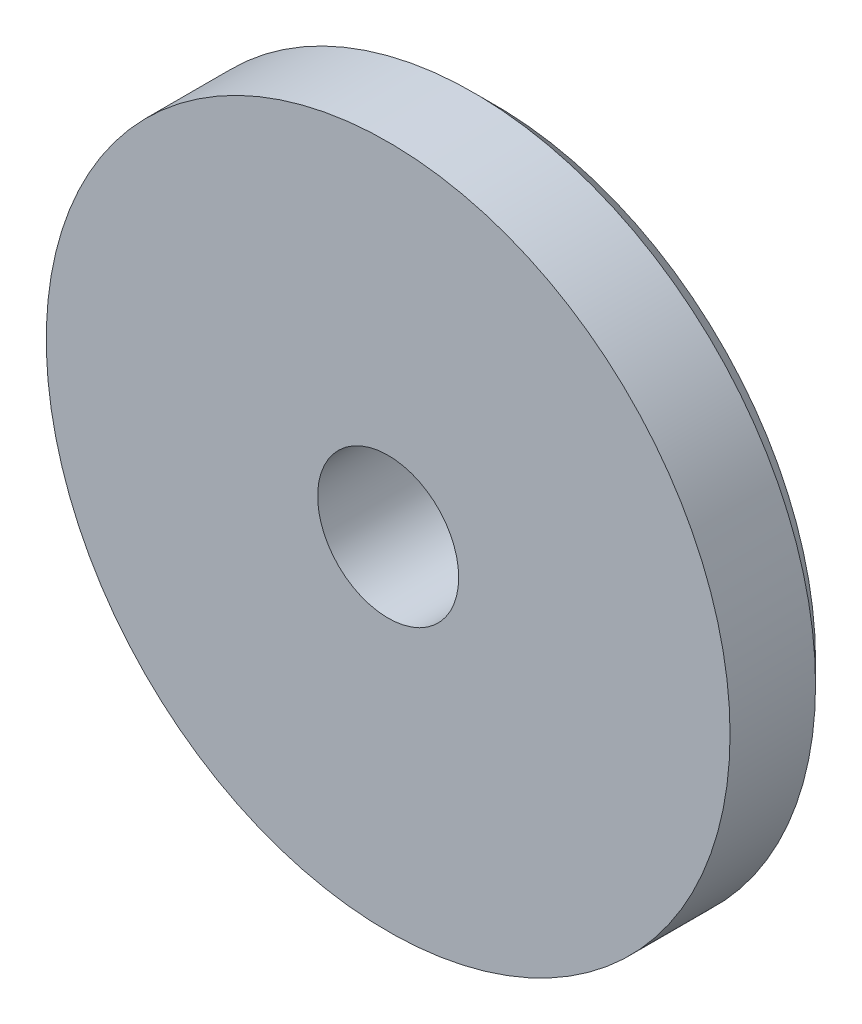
from build123d import *

# Parameters (mm, degrees)
SKETCH_4_W = 1.6
SKETCH_4_H = 1.6


with BuildPart() as part:
    # Sketch 1 → Revolve 1 (revolve)
    with BuildSketch(Plane(origin=(0, 0, 0), x_dir=(0, 0, -1), z_dir=(1, 0, 0)), mode=Mode.PRIVATE) as revolve_1_sk:
        Polygon((0, 3.3), (5, 3.3), (5, 15), (4, 16), (0, 16), align=None)
    revolve(revolve_1_sk.sketch.rotate(Axis((0, 0, 0), (0, 0, -1)), 90), axis=Axis((0, 0, 0), (0, 0, -1)))

    # Sketch 4 → Revolve 2 (revolve)
    with BuildSketch(Plane(origin=(0, 0, 0), x_dir=(1, 0, 0), z_dir=(0, 1, 0))):
        with Locations((3.8, 5.8)):
            Rectangle(SKETCH_4_W, SKETCH_4_H)
    revolve(axis=Axis((0, 0, 0), (0, 0, -1)))


solid = part.part
